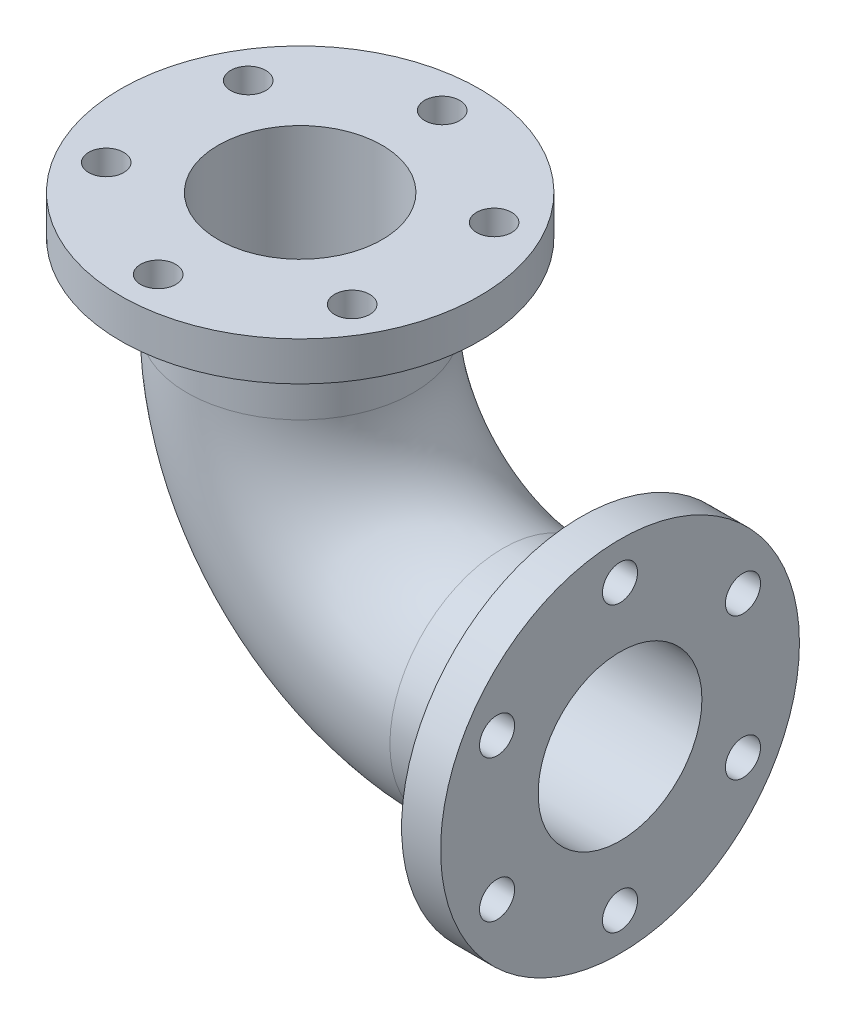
from build123d import *

# Parameters (mm, degrees)
SWEEP_THIN1_PROFILE_R   = 145
SWEEP_THIN1_PROFILE_R_2 = 105
SKETCH30_R              = 230
SKETCH30_R_2            = 105
BOSS_EXTRUDE1_DEPTH     = 50
CUT_EXTRUDE1_REACH      = 702.375
SKETCH31_R              = 22.5
CIRPATTERN1_COUNT       = 6
BOSS_EXTRUDE2_START     = 50
SKETCH32_R              = 230
SKETCH32_R_2            = 105
BOSS_EXTRUDE2_DEPTH     = 50
CUT_EXTRUDE2_REACH      = 902.333
SKETCH33_R              = 22.5
CIRPATTERN2_COUNT       = 6


with BuildPart() as part:
    # Sweep-Thin1: sweep along a path in Sketch1
    with BuildLine(Plane.XY) as sweep_thin1_path:
        Line((0, 0), (0, -100))
        ThreePointArc((0, -100), (76.152236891, -283.847763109), (260, -360))
        Line((260, -360), (360, -360))
    # Sweep-Thin1 profile (on start of the path) → Sweep-Thin1 (sweep)
    with BuildSketch(Plane(origin=(0, 0, 0), x_dir=(0, 0, -1), z_dir=(0, -1, 0))):
        Circle(SWEEP_THIN1_PROFILE_R)
        Circle(SWEEP_THIN1_PROFILE_R_2, mode=Mode.SUBTRACT)
    sweep(path=sweep_thin1_path.line)

    # Sketch30 → Boss-Extrude1 (add)
    with BuildSketch(Plane(origin=(0, 0, 0), x_dir=(1, 0, 0), z_dir=(0, 1, 0))):
        with Locations(Location((0, 0, 0), (0, 0, 180))):
            Circle(SKETCH30_R)
        with Locations(Location((0, 0, 0), (0, 0, 180))):
            Circle(SKETCH30_R_2, mode=Mode.SUBTRACT)
    extrude(amount=BOSS_EXTRUDE1_DEPTH)

    # Sketch31 → Cut-Extrude1 (cut, up to next)
    with BuildSketch(Plane(origin=(0, 50, 0), x_dir=(1, 0, 0), z_dir=(0, 1, 0)), mode=Mode.PRIVATE) as cut_extrude1_sk1:
        with Locations(Location((0, 182, 0), (0, 0, 180))):
            Circle(SKETCH31_R)
    cut_extrude1_tool1 = extrude(cut_extrude1_sk1.sketch, amount=-CUT_EXTRUDE1_REACH, mode=Mode.PRIVATE) & part.part
    cut_extrude1 = cut_extrude1_tool1.solids().sort_by_distance((0, 50, -182))[0]
    add(cut_extrude1, mode=Mode.SUBTRACT)

    # CirPattern1: Cut-Extrude1 ×6 about axis
    cirpattern1_axis = Axis((0, 0, 0), (0, 1, 0))
    for i in range(1, CIRPATTERN1_COUNT):
        add(cut_extrude1.rotate(cirpattern1_axis, i * 360 / CIRPATTERN1_COUNT), mode=Mode.SUBTRACT)

    # Sketch32 → Boss-Extrude2 (add)
    with BuildSketch(Plane(origin=(360, 0, 0), x_dir=(0, 0, -1), z_dir=(1, 0, 0)).offset(BOSS_EXTRUDE2_START)):
        with Locations((0, -360)):
            Circle(SKETCH32_R)
        with Locations((0, -360)):
            Circle(SKETCH32_R_2, mode=Mode.SUBTRACT)
    extrude(amount=-BOSS_EXTRUDE2_DEPTH)

    # Sketch33 → Cut-Extrude2 (cut, up to next)
    with BuildSketch(Plane(origin=(410, 0, 0), x_dir=(0, 0, -1), z_dir=(1, 0, 0)), mode=Mode.PRIVATE) as cut_extrude2_sk1:
        with Locations((0, -542)):
            Circle(SKETCH33_R)
    cut_extrude2_tool1 = extrude(cut_extrude2_sk1.sketch, amount=-CUT_EXTRUDE2_REACH, mode=Mode.PRIVATE) & part.part
    cut_extrude2 = cut_extrude2_tool1.solids().sort_by_distance((410, -542, 0))[0]
    add(cut_extrude2, mode=Mode.SUBTRACT)

    # CirPattern2: Cut-Extrude2 ×6 about axis
    cirpattern2_axis = Axis((0, -360, 0), (1, 0, 0))
    for i in range(1, CIRPATTERN2_COUNT):
        add(cut_extrude2.rotate(cirpattern2_axis, i * 360 / CIRPATTERN2_COUNT), mode=Mode.SUBTRACT)


solid = part.part
